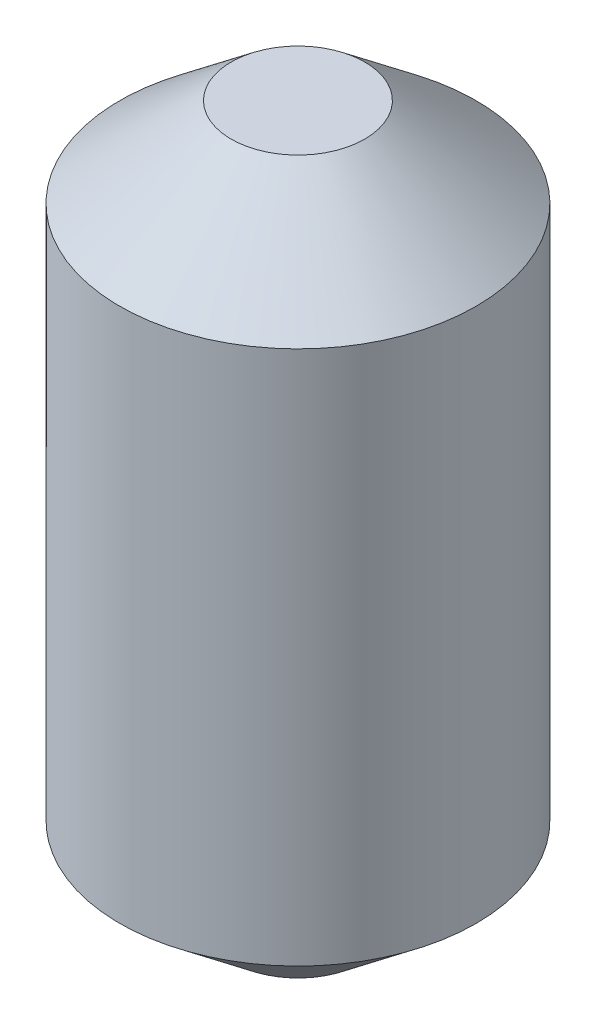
ISO-10303-21;
HEADER;
FILE_DESCRIPTION(('STEP AP214'),'2;1');
FILE_NAME('part.step','',(''),(''),'','','');
FILE_SCHEMA(('AUTOMOTIVE_DESIGN { 1 0 10303 214 1 1 1 1 }'));
ENDSEC;
DATA;
#1=APPLICATION_CONTEXT('core data for automotive mechanical design processes');
#2=APPLICATION_PROTOCOL_DEFINITION('international standard','automotive_design',2000,#1);
#3=PRODUCT_CONTEXT('',#1,'mechanical');
#4=PRODUCT('Part','Part','',(#3));
#5=PRODUCT_RELATED_PRODUCT_CATEGORY('part','',(#4));
#6=PRODUCT_DEFINITION_FORMATION('','',#4);
#7=PRODUCT_DEFINITION_CONTEXT('part definition',#1,'design');
#8=PRODUCT_DEFINITION('design','',#6,#7);
#9=PRODUCT_DEFINITION_SHAPE('','',#8);
#10=(LENGTH_UNIT() NAMED_UNIT(*) SI_UNIT(.MILLI.,.METRE.));
#11=(NAMED_UNIT(*) PLANE_ANGLE_UNIT() SI_UNIT($,.RADIAN.));
#12=(NAMED_UNIT(*) SI_UNIT($,.STERADIAN.) SOLID_ANGLE_UNIT());
#13=UNCERTAINTY_MEASURE_WITH_UNIT(LENGTH_MEASURE(1.E-05),#10,'distance_accuracy_value','');
#14=(GEOMETRIC_REPRESENTATION_CONTEXT(3) GLOBAL_UNCERTAINTY_ASSIGNED_CONTEXT((#13)) GLOBAL_UNIT_ASSIGNED_CONTEXT((#10,
#11,#12)) REPRESENTATION_CONTEXT('',''));
#15=CARTESIAN_POINT('',(0.,0.,0.));
#16=DIRECTION('',(0.,0.,1.));
#17=DIRECTION('',(1.,0.,0.));
#18=AXIS2_PLACEMENT_3D('',#15,#16,#17);
#19=CARTESIAN_POINT('',(0.,-16000.,0.));
#20=DIRECTION('',(0.,-1.,0.));
#21=DIRECTION('',(0.,0.,-1.));
#22=AXIS2_PLACEMENT_3D('',#19,#20,#21);
#23=PLANE('',#22);
#24=CARTESIAN_POINT('',(0.,-16000.,0.));
#25=DIRECTION('',(0.,-1.,0.));
#26=DIRECTION('',(0.,0.,-1.));
#27=AXIS2_PLACEMENT_3D('',#24,#25,#26);
#28=CIRCLE('',#27,3000.);
#29=CARTESIAN_POINT('',(3000.,-16000.,5.38759106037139E-07));
#30=VERTEX_POINT('',#29);
#31=CARTESIAN_POINT('',(3000.,-16000.,0.));
#32=VERTEX_POINT('',#31);
#33=EDGE_CURVE('E11',#30,#32,#28,.T.);
#34=ORIENTED_EDGE('',*,*,#33,.T.);
#35=DIRECTION('',(1.,0.,0.));
#36=VECTOR('',#35,1.);
#37=CARTESIAN_POINT('',(0.,-16000.,0.));
#38=LINE('',#37,#36);
#39=CARTESIAN_POINT('',(0.,-16000.,0.));
#40=VERTEX_POINT('',#39);
#41=EDGE_CURVE('E88',#40,#32,#38,.T.);
#42=ORIENTED_EDGE('',*,*,#41,.F.);
#43=DIRECTION('',(1.,0.,1.79586368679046E-10));
#44=VECTOR('',#43,1.);
#45=CARTESIAN_POINT('',(0.,-16000.,0.));
#46=LINE('',#45,#44);
#47=EDGE_CURVE('E86',#40,#30,#46,.T.);
#48=ORIENTED_EDGE('',*,*,#47,.T.);
#49=EDGE_LOOP('',(#34,#42,#48));
#50=FACE_BOUND('',#49,.T.);
#51=ADVANCED_FACE('F39',(#50),#23,.T.);
#52=CARTESIAN_POINT('',(0.,-16000.,0.));
#53=DIRECTION('',(0.,1.,0.));
#54=DIRECTION('',(0.,0.,1.));
#55=AXIS2_PLACEMENT_3D('',#52,#53,#54);
#56=CONICAL_SURFACE('',#55,3000.,0.896055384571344);
#57=CARTESIAN_POINT('',(0.,-12000.,0.));
#58=DIRECTION('',(0.,-1.,0.));
#59=DIRECTION('',(0.,0.,-1.));
#60=AXIS2_PLACEMENT_3D('',#57,#58,#59);
#61=CIRCLE('',#60,8000.);
#62=CARTESIAN_POINT('',(8000.,-12000.,1.43669094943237E-06));
#63=VERTEX_POINT('',#62);
#64=CARTESIAN_POINT('',(8000.,-12000.,0.));
#65=VERTEX_POINT('',#64);
#66=EDGE_CURVE('E46',#63,#65,#61,.T.);
#67=ORIENTED_EDGE('',*,*,#66,.T.);
#68=DIRECTION('',(0.78086880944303,0.624695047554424,0.));
#69=VECTOR('',#68,1.);
#70=CARTESIAN_POINT('',(3000.,-16000.,0.));
#71=LINE('',#70,#69);
#72=EDGE_CURVE('E96',#32,#65,#71,.T.);
#73=ORIENTED_EDGE('',*,*,#72,.F.);
#74=ORIENTED_EDGE('',*,*,#33,.F.);
#75=DIRECTION('',(0.78086880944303,0.624695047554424,1.40233393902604E-10));
#76=VECTOR('',#75,1.);
#77=CARTESIAN_POINT('',(3000.,-16000.,5.38759106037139E-07));
#78=LINE('',#77,#76);
#79=EDGE_CURVE('E109',#30,#63,#78,.T.);
#80=ORIENTED_EDGE('',*,*,#79,.T.);
#81=EDGE_LOOP('',(#67,#73,#74,#80));
#82=FACE_BOUND('',#81,.T.);
#83=ADVANCED_FACE('F99',(#82),#56,.T.);
#84=CARTESIAN_POINT('',(0.,-16000.,0.));
#85=DIRECTION('',(0.,-1.,0.));
#86=DIRECTION('',(0.,0.,-1.));
#87=AXIS2_PLACEMENT_3D('',#84,#85,#86);
#88=CYLINDRICAL_SURFACE('',#87,8000.);
#89=CARTESIAN_POINT('',(0.,12000.,0.));
#90=DIRECTION('',(0.,-1.,0.));
#91=DIRECTION('',(0.,0.,-1.));
#92=AXIS2_PLACEMENT_3D('',#89,#90,#91);
#93=CIRCLE('',#92,8000.);
#94=CARTESIAN_POINT('',(8000.,12000.,1.43669094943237E-06));
#95=VERTEX_POINT('',#94);
#96=CARTESIAN_POINT('',(8000.,12000.,0.));
#97=VERTEX_POINT('',#96);
#98=EDGE_CURVE('E118',#95,#97,#93,.T.);
#99=ORIENTED_EDGE('',*,*,#98,.T.);
#100=DIRECTION('',(0.,1.,0.));
#101=VECTOR('',#100,1.);
#102=CARTESIAN_POINT('',(8000.,-12000.,0.));
#103=LINE('',#102,#101);
#104=EDGE_CURVE('E101',#65,#97,#103,.T.);
#105=ORIENTED_EDGE('',*,*,#104,.F.);
#106=ORIENTED_EDGE('',*,*,#66,.F.);
#107=DIRECTION('',(0.,1.,0.));
#108=VECTOR('',#107,1.);
#109=CARTESIAN_POINT('',(8000.,-12000.,1.43669094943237E-06));
#110=LINE('',#109,#108);
#111=EDGE_CURVE('E115',#63,#95,#110,.T.);
#112=ORIENTED_EDGE('',*,*,#111,.T.);
#113=EDGE_LOOP('',(#99,#105,#106,#112));
#114=FACE_BOUND('',#113,.T.);
#115=ADVANCED_FACE('F125',(#114),#88,.T.);
#116=CARTESIAN_POINT('',(0.,12000.,0.));
#117=DIRECTION('',(0.,-1.,0.));
#118=DIRECTION('',(0.,0.,-1.));
#119=AXIS2_PLACEMENT_3D('',#116,#117,#118);
#120=CONICAL_SURFACE('',#119,8000.,0.896055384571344);
#121=CARTESIAN_POINT('',(0.,16000.,0.));
#122=DIRECTION('',(0.,-1.,0.));
#123=DIRECTION('',(0.,0.,-1.));
#124=AXIS2_PLACEMENT_3D('',#121,#122,#123);
#125=CIRCLE('',#124,3000.);
#126=CARTESIAN_POINT('',(3000.,16000.,5.38759106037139E-07));
#127=VERTEX_POINT('',#126);
#128=CARTESIAN_POINT('',(3000.,16000.,0.));
#129=VERTEX_POINT('',#128);
#130=EDGE_CURVE('E58',#127,#129,#125,.T.);
#131=ORIENTED_EDGE('',*,*,#130,.T.);
#132=DIRECTION('',(-0.78086880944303,0.624695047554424,0.));
#133=VECTOR('',#132,1.);
#134=CARTESIAN_POINT('',(8000.,12000.,0.));
#135=LINE('',#134,#133);
#136=EDGE_CURVE('E103',#97,#129,#135,.T.);
#137=ORIENTED_EDGE('',*,*,#136,.F.);
#138=ORIENTED_EDGE('',*,*,#98,.F.);
#139=DIRECTION('',(-0.78086880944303,0.624695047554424,-1.40233393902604E-10));
#140=VECTOR('',#139,1.);
#141=CARTESIAN_POINT('',(8000.,12000.,1.43669094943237E-06));
#142=LINE('',#141,#140);
#143=EDGE_CURVE('E113',#95,#127,#142,.T.);
#144=ORIENTED_EDGE('',*,*,#143,.T.);
#145=EDGE_LOOP('',(#131,#137,#138,#144));
#146=FACE_BOUND('',#145,.T.);
#147=ADVANCED_FACE('F130',(#146),#120,.T.);
#148=CARTESIAN_POINT('',(3000.,16000.,5.38759106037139E-07));
#149=DIRECTION('',(0.,1.,0.));
#150=DIRECTION('',(0.,0.,1.));
#151=AXIS2_PLACEMENT_3D('',#148,#149,#150);
#152=PLANE('',#151);
#153=DIRECTION('',(-1.,0.,-1.79586368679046E-10));
#154=VECTOR('',#153,1.);
#155=CARTESIAN_POINT('',(3000.,16000.,5.38759106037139E-07));
#156=LINE('',#155,#154);
#157=CARTESIAN_POINT('',(0.,16000.,0.));
#158=VERTEX_POINT('',#157);
#159=EDGE_CURVE('E120',#127,#158,#156,.T.);
#160=ORIENTED_EDGE('',*,*,#159,.T.);
#161=DIRECTION('',(-1.,0.,0.));
#162=VECTOR('',#161,1.);
#163=CARTESIAN_POINT('',(3000.,16000.,0.));
#164=LINE('',#163,#162);
#165=EDGE_CURVE('E52',#129,#158,#164,.T.);
#166=ORIENTED_EDGE('',*,*,#165,.F.);
#167=ORIENTED_EDGE('',*,*,#130,.F.);
#168=EDGE_LOOP('',(#160,#166,#167));
#169=FACE_BOUND('',#168,.T.);
#170=ADVANCED_FACE('F132',(#169),#152,.T.);
#171=CARTESIAN_POINT('',(0.,0.,0.));
#172=DIRECTION('',(-1.79586368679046E-10,0.,1.));
#173=DIRECTION('',(1.,0.,1.79586368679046E-10));
#174=AXIS2_PLACEMENT_3D('',#171,#172,#173);
#175=PLANE('',#174);
#176=DIRECTION('',(0.,-1.,0.));
#177=VECTOR('',#176,1.);
#178=CARTESIAN_POINT('',(0.,16000.,0.));
#179=LINE('',#178,#177);
#180=EDGE_CURVE('E98',#158,#40,#179,.T.);
#181=ORIENTED_EDGE('',*,*,#180,.F.);
#182=ORIENTED_EDGE('',*,*,#159,.F.);
#183=ORIENTED_EDGE('',*,*,#143,.F.);
#184=ORIENTED_EDGE('',*,*,#111,.F.);
#185=ORIENTED_EDGE('',*,*,#79,.F.);
#186=ORIENTED_EDGE('',*,*,#47,.F.);
#187=EDGE_LOOP('',(#181,#182,#183,#184,#185,#186));
#188=FACE_BOUND('',#187,.T.);
#189=ADVANCED_FACE('F128',(#188),#175,.F.);
#190=CARTESIAN_POINT('',(0.,0.,0.));
#191=DIRECTION('',(0.,0.,1.));
#192=DIRECTION('',(1.,0.,0.));
#193=AXIS2_PLACEMENT_3D('',#190,#191,#192);
#194=PLANE('',#193);
#195=ORIENTED_EDGE('',*,*,#180,.T.);
#196=ORIENTED_EDGE('',*,*,#41,.T.);
#197=ORIENTED_EDGE('',*,*,#72,.T.);
#198=ORIENTED_EDGE('',*,*,#104,.T.);
#199=ORIENTED_EDGE('',*,*,#136,.T.);
#200=ORIENTED_EDGE('',*,*,#165,.T.);
#201=EDGE_LOOP('',(#195,#196,#197,#198,#199,#200));
#202=FACE_BOUND('',#201,.T.);
#203=ADVANCED_FACE('F94',(#202),#194,.T.);
#204=CLOSED_SHELL('',(#51,#83,#115,#147,#170,#189,#203));
#205=MANIFOLD_SOLID_BREP('B2',#204);
#206=ADVANCED_BREP_SHAPE_REPRESENTATION('',(#18,#205),#14);
#207=SHAPE_DEFINITION_REPRESENTATION(#9,#206);
ENDSEC;
END-ISO-10303-21;
